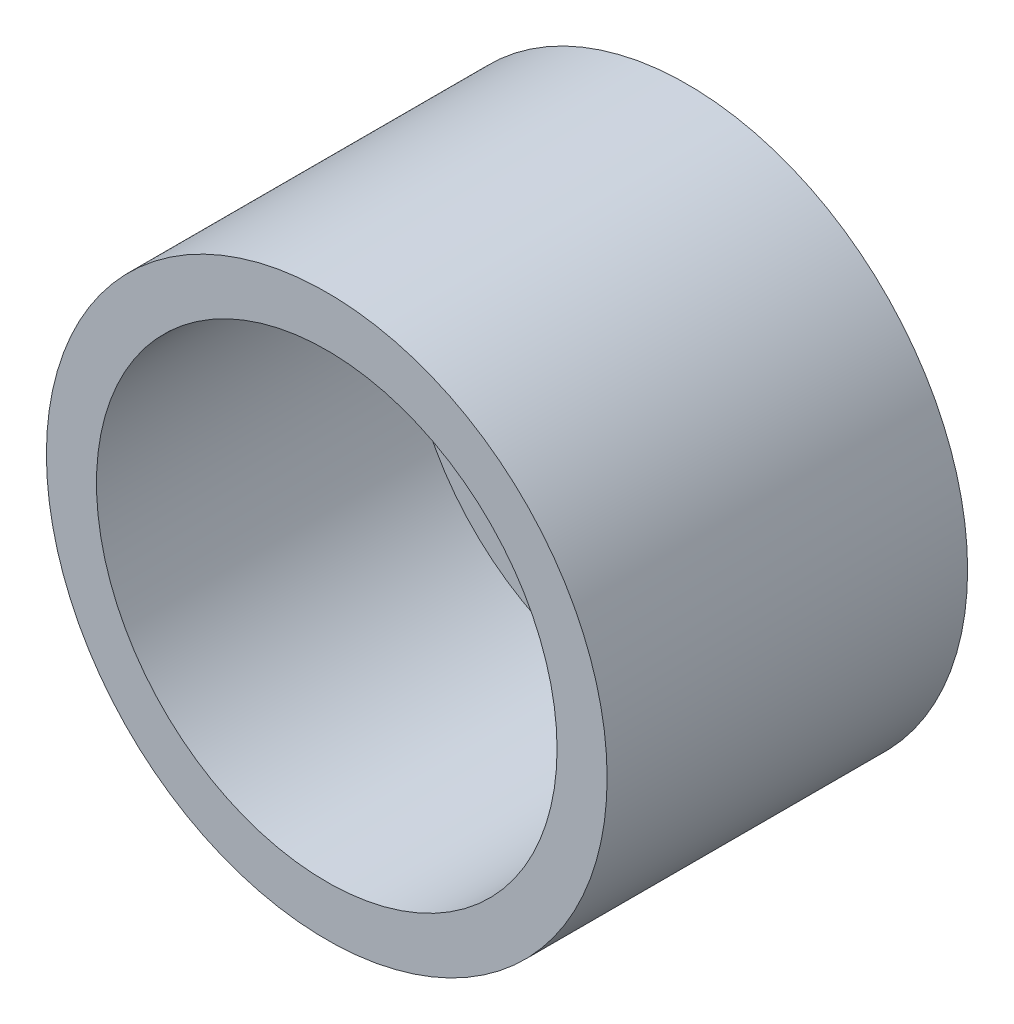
ISO-10303-21;
HEADER;
FILE_DESCRIPTION(('STEP AP214'),'2;1');
FILE_NAME('part.step','',(''),(''),'','','');
FILE_SCHEMA(('AUTOMOTIVE_DESIGN { 1 0 10303 214 1 1 1 1 }'));
ENDSEC;
DATA;
#1=APPLICATION_CONTEXT('core data for automotive mechanical design processes');
#2=APPLICATION_PROTOCOL_DEFINITION('international standard','automotive_design',2000,#1);
#3=PRODUCT_CONTEXT('',#1,'mechanical');
#4=PRODUCT('Part','Part','',(#3));
#5=PRODUCT_RELATED_PRODUCT_CATEGORY('part','',(#4));
#6=PRODUCT_DEFINITION_FORMATION('','',#4);
#7=PRODUCT_DEFINITION_CONTEXT('part definition',#1,'design');
#8=PRODUCT_DEFINITION('design','',#6,#7);
#9=PRODUCT_DEFINITION_SHAPE('','',#8);
#10=(LENGTH_UNIT() NAMED_UNIT(*) SI_UNIT(.MILLI.,.METRE.));
#11=(NAMED_UNIT(*) PLANE_ANGLE_UNIT() SI_UNIT($,.RADIAN.));
#12=(NAMED_UNIT(*) SI_UNIT($,.STERADIAN.) SOLID_ANGLE_UNIT());
#13=UNCERTAINTY_MEASURE_WITH_UNIT(LENGTH_MEASURE(1.E-05),#10,'distance_accuracy_value','');
#14=(GEOMETRIC_REPRESENTATION_CONTEXT(3) GLOBAL_UNCERTAINTY_ASSIGNED_CONTEXT((#13)) GLOBAL_UNIT_ASSIGNED_CONTEXT((#10,
#11,#12)) REPRESENTATION_CONTEXT('',''));
#15=CARTESIAN_POINT('',(0.,0.,0.));
#16=DIRECTION('',(0.,0.,1.));
#17=DIRECTION('',(1.,0.,0.));
#18=AXIS2_PLACEMENT_3D('',#15,#16,#17);
#19=CARTESIAN_POINT('',(0.,0.,18.));
#20=DIRECTION('',(0.,0.,-1.));
#21=DIRECTION('',(-1.,0.,0.));
#22=AXIS2_PLACEMENT_3D('',#19,#20,#21);
#23=CYLINDRICAL_SURFACE('',#22,14.);
#24=CARTESIAN_POINT('',(0.,0.,18.));
#25=DIRECTION('',(0.,0.,1.));
#26=DIRECTION('',(1.,0.,0.));
#27=AXIS2_PLACEMENT_3D('',#24,#25,#26);
#28=CIRCLE('',#27,14.);
#29=CARTESIAN_POINT('',(14.,0.,18.));
#30=VERTEX_POINT('',#29);
#31=EDGE_CURVE('E10',#30,#30,#28,.T.);
#32=ORIENTED_EDGE('',*,*,#31,.F.);
#33=EDGE_LOOP('',(#32));
#34=FACE_BOUND('',#33,.T.);
#35=CARTESIAN_POINT('',(0.,0.,0.));
#36=DIRECTION('',(0.,0.,1.));
#37=DIRECTION('',(1.,0.,0.));
#38=AXIS2_PLACEMENT_3D('',#35,#36,#37);
#39=CIRCLE('',#38,14.);
#40=CARTESIAN_POINT('',(14.,0.,0.));
#41=VERTEX_POINT('',#40);
#42=EDGE_CURVE('E33',#41,#41,#39,.T.);
#43=ORIENTED_EDGE('',*,*,#42,.T.);
#44=EDGE_LOOP('',(#43));
#45=FACE_BOUND('',#44,.T.);
#46=ADVANCED_FACE('F30',(#34,#45),#23,.T.);
#47=CARTESIAN_POINT('',(0.,0.,18.));
#48=DIRECTION('',(0.,0.,1.));
#49=DIRECTION('',(1.,0.,0.));
#50=AXIS2_PLACEMENT_3D('',#47,#48,#49);
#51=PLANE('',#50);
#52=CARTESIAN_POINT('',(0.,0.,18.));
#53=DIRECTION('',(0.,0.,1.));
#54=DIRECTION('',(1.,0.,0.));
#55=AXIS2_PLACEMENT_3D('',#52,#53,#54);
#56=CIRCLE('',#55,11.5);
#57=CARTESIAN_POINT('',(11.5,0.,18.));
#58=VERTEX_POINT('',#57);
#59=EDGE_CURVE('E40',#58,#58,#56,.T.);
#60=ORIENTED_EDGE('',*,*,#59,.F.);
#61=EDGE_LOOP('',(#60));
#62=FACE_BOUND('',#61,.T.);
#63=ORIENTED_EDGE('',*,*,#31,.T.);
#64=EDGE_LOOP('',(#63));
#65=FACE_BOUND('',#64,.T.);
#66=ADVANCED_FACE('F60',(#62,#65),#51,.T.);
#67=CARTESIAN_POINT('',(0.,0.,0.));
#68=DIRECTION('',(0.,0.,1.));
#69=DIRECTION('',(1.,0.,0.));
#70=AXIS2_PLACEMENT_3D('',#67,#68,#69);
#71=PLANE('',#70);
#72=ORIENTED_EDGE('',*,*,#42,.F.);
#73=EDGE_LOOP('',(#72));
#74=FACE_BOUND('',#73,.T.);
#75=ADVANCED_FACE('F52',(#74),#71,.F.);
#76=CARTESIAN_POINT('',(0.,0.,18.));
#77=DIRECTION('',(0.,0.,-1.));
#78=DIRECTION('',(-1.,0.,0.));
#79=AXIS2_PLACEMENT_3D('',#76,#77,#78);
#80=CYLINDRICAL_SURFACE('',#79,11.5);
#81=ORIENTED_EDGE('',*,*,#59,.T.);
#82=EDGE_LOOP('',(#81));
#83=FACE_BOUND('',#82,.T.);
#84=CARTESIAN_POINT('',(0.,0.,2.5));
#85=DIRECTION('',(0.,0.,1.));
#86=DIRECTION('',(1.,0.,0.));
#87=AXIS2_PLACEMENT_3D('',#84,#85,#86);
#88=CIRCLE('',#87,11.5);
#89=CARTESIAN_POINT('',(11.5,0.,2.5));
#90=VERTEX_POINT('',#89);
#91=EDGE_CURVE('E44',#90,#90,#88,.T.);
#92=ORIENTED_EDGE('',*,*,#91,.F.);
#93=EDGE_LOOP('',(#92));
#94=FACE_BOUND('',#93,.T.);
#95=ADVANCED_FACE('F50',(#83,#94),#80,.F.);
#96=CARTESIAN_POINT('',(0.,0.,2.5));
#97=DIRECTION('',(0.,0.,1.));
#98=DIRECTION('',(1.,0.,0.));
#99=AXIS2_PLACEMENT_3D('',#96,#97,#98);
#100=PLANE('',#99);
#101=ORIENTED_EDGE('',*,*,#91,.T.);
#102=EDGE_LOOP('',(#101));
#103=FACE_BOUND('',#102,.T.);
#104=ADVANCED_FACE('F48',(#103),#100,.T.);
#105=CLOSED_SHELL('',(#46,#66,#75,#95,#104));
#106=MANIFOLD_SOLID_BREP('B2',#105);
#107=ADVANCED_BREP_SHAPE_REPRESENTATION('',(#18,#106),#14);
#108=SHAPE_DEFINITION_REPRESENTATION(#9,#107);
ENDSEC;
END-ISO-10303-21;
